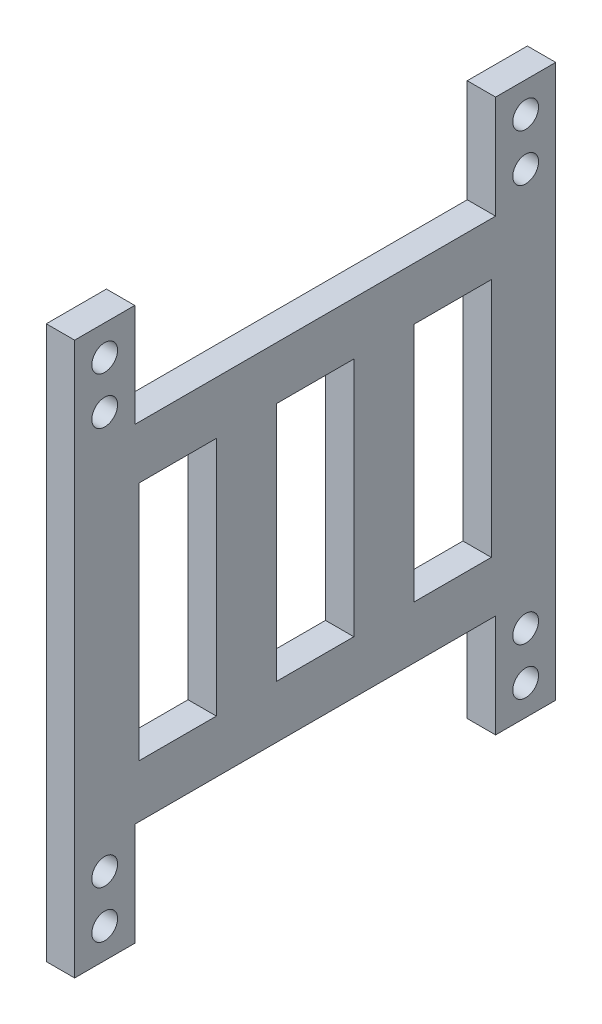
from build123d import *

# Parameters (mm, degrees)
SKETCH2_W           = 7
SKETCH2_H           = 12
SKETCH2_R           = 1.5
BOSS_EXTRUDE1_DEPTH = 3.3
SKETCH3_W           = 9
SKETCH3_H           = 28
CUT_EXTRUDE1_DEPTH  = 10


with BuildPart() as part:
    # Sketch2 → Boss-Extrude1 (new body)
    # profile 1 of 8: a face of its own
    with BuildSketch(Plane(origin=(0, 0, 0), x_dir=(0, 0, -1), z_dir=(1, 0, 0))):
        with Locations((-24.5, 26.15)):
            Rectangle(SKETCH2_W, SKETCH2_H)
        with Locations((-24.5, 23.15)):
            Circle(SKETCH2_R, mode=Mode.SUBTRACT)
        with Locations((-24.5, 28.65)):
            Circle(SKETCH2_R, mode=Mode.SUBTRACT)
    # profile 2 of 8: a face of its own
    with BuildSketch(Plane(origin=(0, 0, 0), x_dir=(0, 0, -1), z_dir=(1, 0, 0))):
        with Locations((24.5, 26.15)):
            Rectangle(SKETCH2_W, SKETCH2_H)
        with Locations((24.5, 23.15)):
            Circle(SKETCH2_R, mode=Mode.SUBTRACT)
        with Locations((24.5, 28.65)):
            Circle(SKETCH2_R, mode=Mode.SUBTRACT)
    # profile 3 of 8: a face of its own
    with BuildSketch(Plane(origin=(0, 0, 0), x_dir=(0, 0, -1), z_dir=(1, 0, 0))):
        Polygon((0, 20.15), (0, 0), (28, 0), (28, 20.15), (21, 20.15), align=None)
    # profile 4 of 8: a face of its own
    with BuildSketch(Plane(origin=(0, 0, 0), x_dir=(0, 0, -1), z_dir=(1, 0, 0))):
        Polygon((-28, 20.15), (-28, 0), (0, 0), (0, 20.15), (-21, 20.15), align=None)
    # profile 5 of 8: a face of its own
    with BuildSketch(Plane(origin=(0, 0, 0), x_dir=(0, 0, -1), z_dir=(1, 0, 0))):
        Polygon((0, 0), (-28, 0), (-28, -20.15), (-21, -20.15), (0, -20.15), align=None)
    # profile 6 of 8: a face of its own
    with BuildSketch(Plane(origin=(0, 0, 0), x_dir=(0, 0, -1), z_dir=(1, 0, 0))):
        Polygon((28, 0), (0, 0), (0, -20.15), (21, -20.15), (28, -20.15), align=None)
    # profile 7 of 8: a face of its own
    with BuildSketch(Plane(origin=(0, 0, 0), x_dir=(0, 0, -1), z_dir=(1, 0, 0))):
        with Locations((24.5, -26.15)):
            Rectangle(SKETCH2_W, SKETCH2_H)
        with Locations((24.5, -28.65)):
            Circle(SKETCH2_R, mode=Mode.SUBTRACT)
        with Locations((24.5, -23.15)):
            Circle(SKETCH2_R, mode=Mode.SUBTRACT)
    # profile 8 of 8: a face of its own
    with BuildSketch(Plane(origin=(0, 0, 0), x_dir=(0, 0, -1), z_dir=(1, 0, 0))):
        with Locations((-24.5, -26.15)):
            Rectangle(SKETCH2_W, SKETCH2_H)
        with Locations((-24.5, -28.65)):
            Circle(SKETCH2_R, mode=Mode.SUBTRACT)
        with Locations((-24.5, -23.15)):
            Circle(SKETCH2_R, mode=Mode.SUBTRACT)
    extrude(amount=BOSS_EXTRUDE1_DEPTH)

    # Sketch3 → Cut-Extrude1 (cut)
    with BuildSketch(Plane(origin=(3.3, 0, 0), x_dir=(0, 0, -1), z_dir=(1, 0, 0))):
        Rectangle(SKETCH3_W, SKETCH3_H)
        with Locations((-16, 0)):
            Rectangle(SKETCH3_W, SKETCH3_H)
        with Locations((16, 0)):
            Rectangle(SKETCH3_W, SKETCH3_H)
    extrude(amount=-CUT_EXTRUDE1_DEPTH, mode=Mode.SUBTRACT)


solid = part.part
